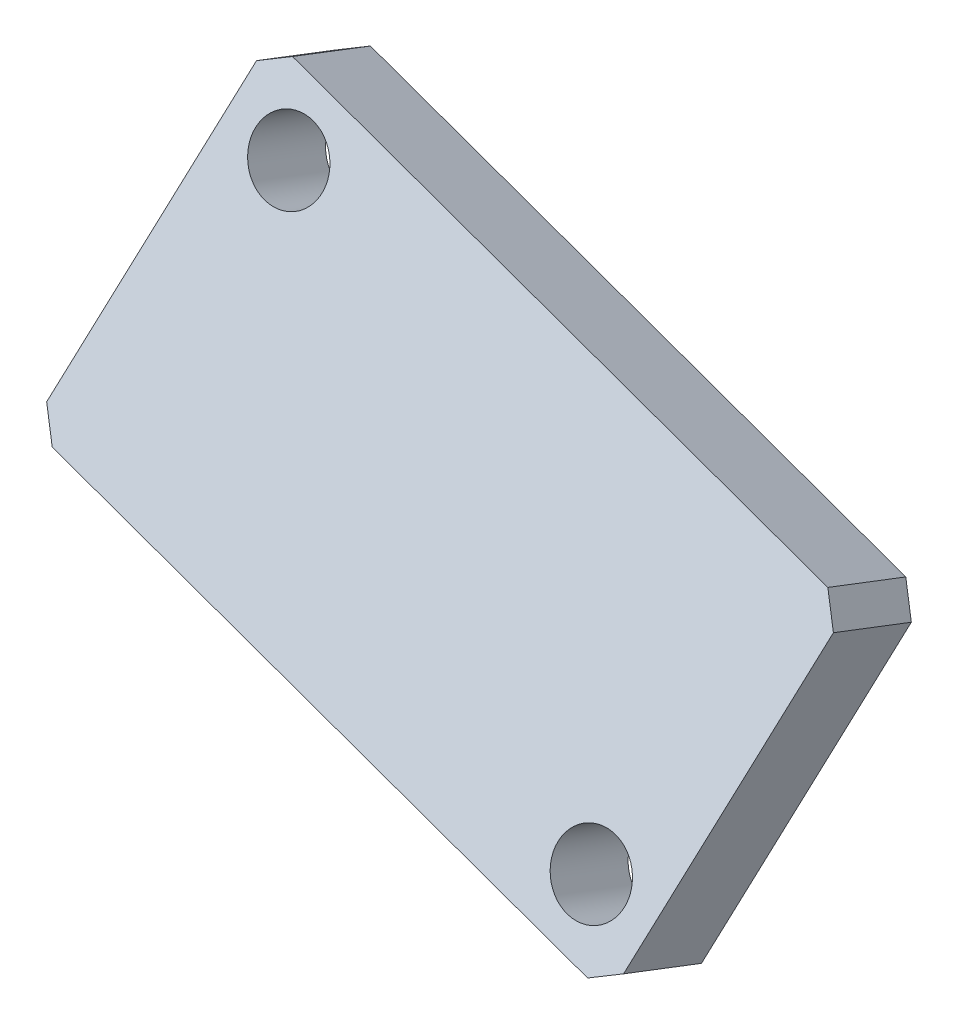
ISO-10303-21;
HEADER;
FILE_DESCRIPTION(('STEP AP214'),'2;1');
FILE_NAME('part.step','',(''),(''),'','','');
FILE_SCHEMA(('AUTOMOTIVE_DESIGN { 1 0 10303 214 1 1 1 1 }'));
ENDSEC;
DATA;
#1=APPLICATION_CONTEXT('core data for automotive mechanical design processes');
#2=APPLICATION_PROTOCOL_DEFINITION('international standard','automotive_design',2000,#1);
#3=PRODUCT_CONTEXT('',#1,'mechanical');
#4=PRODUCT('Part','Part','',(#3));
#5=PRODUCT_RELATED_PRODUCT_CATEGORY('part','',(#4));
#6=PRODUCT_DEFINITION_FORMATION('','',#4);
#7=PRODUCT_DEFINITION_CONTEXT('part definition',#1,'design');
#8=PRODUCT_DEFINITION('design','',#6,#7);
#9=PRODUCT_DEFINITION_SHAPE('','',#8);
#10=(LENGTH_UNIT() NAMED_UNIT(*) SI_UNIT(.MILLI.,.METRE.));
#11=(NAMED_UNIT(*) PLANE_ANGLE_UNIT() SI_UNIT($,.RADIAN.));
#12=(NAMED_UNIT(*) SI_UNIT($,.STERADIAN.) SOLID_ANGLE_UNIT());
#13=UNCERTAINTY_MEASURE_WITH_UNIT(LENGTH_MEASURE(1.E-05),#10,'distance_accuracy_value','');
#14=(GEOMETRIC_REPRESENTATION_CONTEXT(3) GLOBAL_UNCERTAINTY_ASSIGNED_CONTEXT((#13)) GLOBAL_UNIT_ASSIGNED_CONTEXT((#10,
#11,#12)) REPRESENTATION_CONTEXT('',''));
#15=CARTESIAN_POINT('',(0.,0.,0.));
#16=DIRECTION('',(0.,0.,1.));
#17=DIRECTION('',(1.,0.,0.));
#18=AXIS2_PLACEMENT_3D('',#15,#16,#17);
#19=CARTESIAN_POINT('',(54.9942323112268,-5.08060620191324,-242.139668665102));
#20=DIRECTION('',(-0.0641332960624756,-0.391467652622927,-0.917954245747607));
#21=DIRECTION('',(0.,0.919847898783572,-0.392275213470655));
#22=AXIS2_PLACEMENT_3D('',#19,#20,#21);
#23=PLANE('',#22);
#24=CARTESIAN_POINT('',(30.2599275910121,-0.556920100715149,-242.340750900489));
#25=DIRECTION('',(0.0641332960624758,0.391467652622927,0.917954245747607));
#26=DIRECTION('',(0.,-0.919847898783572,0.392275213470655));
#27=AXIS2_PLACEMENT_3D('',#24,#25,#26);
#28=CIRCLE('',#27,1.6);
#29=CARTESIAN_POINT('',(30.2599275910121,-2.02867673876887,-241.713110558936));
#30=VERTEX_POINT('',#29);
#31=EDGE_CURVE('E165',#30,#30,#28,.T.);
#32=ORIENTED_EDGE('',*,*,#31,.F.);
#33=EDGE_LOOP('',(#32));
#34=FACE_BOUND('',#33,.T.);
#35=DIRECTION('',(0.959896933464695,-0.275760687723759,0.0505363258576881));
#36=VECTOR('',#35,1.);
#37=CARTESIAN_POINT('',(50.6821116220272,-18.9514325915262,-235.923094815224));
#38=LINE('',#37,#36);
#39=CARTESIAN_POINT('',(24.9568738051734,-11.5610461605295,-237.27746834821));
#40=VERTEX_POINT('',#39);
#41=CARTESIAN_POINT('',(49.7222146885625,-18.6756719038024,-235.973631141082));
#42=VERTEX_POINT('',#41);
#43=EDGE_CURVE('E172',#40,#42,#38,.T.);
#44=ORIENTED_EDGE('',*,*,#43,.T.);
#45=DIRECTION('',(-0.871732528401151,-0.425777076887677,0.242479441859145));
#46=VECTOR('',#45,1.);
#47=CARTESIAN_POINT('',(50.9550306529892,-18.0735321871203,-236.316548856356));
#48=LINE('',#47,#46);
#49=CARTESIAN_POINT('',(50.9550306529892,-18.0735321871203,-236.316548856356));
#50=VERTEX_POINT('',#49);
#51=EDGE_CURVE('E149',#42,#50,#48,.F.);
#52=ORIENTED_EDGE('',*,*,#51,.T.);
#53=DIRECTION('',(0.272919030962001,0.877900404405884,-0.39345404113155));
#54=VECTOR('',#53,1.);
#55=CARTESIAN_POINT('',(54.9942323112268,-5.08060620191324,-242.139668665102));
#56=LINE('',#55,#54);
#57=CARTESIAN_POINT('',(54.7213132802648,-5.95850660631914,-241.746214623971));
#58=VERTEX_POINT('',#57);
#59=EDGE_CURVE('E120',#50,#58,#56,.T.);
#60=ORIENTED_EDGE('',*,*,#59,.T.);
#61=DIRECTION('',(0.485766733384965,-0.815761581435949,0.313948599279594));
#62=VECTOR('',#61,1.);
#63=CARTESIAN_POINT('',(54.0343353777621,-4.80484551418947,-242.19020499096));
#64=LINE('',#63,#62);
#65=CARTESIAN_POINT('',(54.0343353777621,-4.80484551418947,-242.19020499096));
#66=VERTEX_POINT('',#65);
#67=EDGE_CURVE('E147',#58,#66,#64,.F.);
#68=ORIENTED_EDGE('',*,*,#67,.T.);
#69=DIRECTION('',(-0.959896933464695,0.275760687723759,-0.0505363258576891));
#70=VECTOR('',#69,1.);
#71=CARTESIAN_POINT('',(28.3090975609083,2.58554091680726,-243.544578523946));
#72=LINE('',#71,#70);
#73=CARTESIAN_POINT('',(29.268994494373,2.3097802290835,-243.494042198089));
#74=VERTEX_POINT('',#73);
#75=EDGE_CURVE('E127',#66,#74,#72,.T.);
#76=ORIENTED_EDGE('',*,*,#75,.T.);
#77=DIRECTION('',(0.87173252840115,0.425777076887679,-0.242479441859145));
#78=VECTOR('',#77,1.);
#79=CARTESIAN_POINT('',(28.0361785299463,1.70764051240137,-243.151124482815));
#80=LINE('',#79,#78);
#81=CARTESIAN_POINT('',(28.0361785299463,1.70764051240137,-243.151124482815));
#82=VERTEX_POINT('',#81);
#83=EDGE_CURVE('E55',#74,#82,#80,.F.);
#84=ORIENTED_EDGE('',*,*,#83,.T.);
#85=DIRECTION('',(-0.272919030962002,-0.877900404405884,0.393454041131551));
#86=VECTOR('',#85,1.);
#87=CARTESIAN_POINT('',(23.9969768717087,-11.2852854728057,-237.328004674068));
#88=LINE('',#87,#86);
#89=CARTESIAN_POINT('',(24.2698959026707,-10.4073850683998,-237.721458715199));
#90=VERTEX_POINT('',#89);
#91=EDGE_CURVE('E130',#82,#90,#88,.T.);
#92=ORIENTED_EDGE('',*,*,#91,.T.);
#93=DIRECTION('',(-0.485766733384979,0.815761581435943,-0.313948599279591));
#94=VECTOR('',#93,1.);
#95=CARTESIAN_POINT('',(24.9568738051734,-11.5610461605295,-237.27746834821));
#96=LINE('',#95,#94);
#97=EDGE_CURVE('E144',#90,#40,#96,.F.);
#98=ORIENTED_EDGE('',*,*,#97,.T.);
#99=EDGE_LOOP('',(#44,#52,#60,#68,#76,#84,#92,#98));
#100=FACE_BOUND('',#99,.T.);
#101=CARTESIAN_POINT('',(48.7312815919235,-15.8089715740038,-237.126922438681));
#102=DIRECTION('',(0.0641332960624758,0.391467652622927,0.917954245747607));
#103=DIRECTION('',(0.,-0.919847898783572,0.392275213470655));
#104=AXIS2_PLACEMENT_3D('',#101,#102,#103);
#105=CIRCLE('',#104,1.59999999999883);
#106=CARTESIAN_POINT('',(48.7312815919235,-17.2807282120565,-236.499282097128));
#107=VERTEX_POINT('',#106);
#108=EDGE_CURVE('E177',#107,#107,#105,.T.);
#109=ORIENTED_EDGE('',*,*,#108,.F.);
#110=EDGE_LOOP('',(#109));
#111=FACE_BOUND('',#110,.T.);
#112=ADVANCED_FACE('F34',(#34,#100,#111),#23,.F.);
#113=CARTESIAN_POINT('',(54.7376991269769,-6.64647681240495,-245.811485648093));
#114=DIRECTION('',(-0.0641332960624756,-0.391467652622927,-0.917954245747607));
#115=DIRECTION('',(0.,0.919847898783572,-0.392275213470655));
#116=AXIS2_PLACEMENT_3D('',#113,#114,#115);
#117=PLANE('',#116);
#118=CARTESIAN_POINT('',(30.0033944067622,-2.12279071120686,-246.01256788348));
#119=DIRECTION('',(0.0641332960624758,0.391467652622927,0.917954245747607));
#120=DIRECTION('',(0.,-0.919847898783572,0.392275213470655));
#121=AXIS2_PLACEMENT_3D('',#118,#119,#120);
#122=CIRCLE('',#121,1.6);
#123=CARTESIAN_POINT('',(30.0033944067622,-3.59454734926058,-245.384927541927));
#124=VERTEX_POINT('',#123);
#125=EDGE_CURVE('E168',#124,#124,#122,.T.);
#126=ORIENTED_EDGE('',*,*,#125,.T.);
#127=EDGE_LOOP('',(#126));
#128=FACE_BOUND('',#127,.T.);
#129=DIRECTION('',(0.272919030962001,0.877900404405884,-0.39345404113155));
#130=VECTOR('',#129,1.);
#131=CARTESIAN_POINT('',(54.7376991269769,-6.64647681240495,-245.811485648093));
#132=LINE('',#131,#130);
#133=CARTESIAN_POINT('',(50.6984974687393,-19.639402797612,-239.988365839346));
#134=VERTEX_POINT('',#133);
#135=CARTESIAN_POINT('',(54.4647800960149,-7.52437721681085,-245.418031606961));
#136=VERTEX_POINT('',#135);
#137=EDGE_CURVE('E117',#134,#136,#132,.T.);
#138=ORIENTED_EDGE('',*,*,#137,.F.);
#139=DIRECTION('',(0.871732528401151,0.425777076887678,-0.242479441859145));
#140=VECTOR('',#139,1.);
#141=CARTESIAN_POINT('',(59.8213356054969,-15.1835688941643,-242.525956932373));
#142=LINE('',#141,#140);
#143=CARTESIAN_POINT('',(49.4656815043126,-20.2415425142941,-239.645448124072));
#144=VERTEX_POINT('',#143);
#145=EDGE_CURVE('E100',#134,#144,#142,.F.);
#146=ORIENTED_EDGE('',*,*,#145,.T.);
#147=DIRECTION('',(0.959896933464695,-0.275760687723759,0.0505363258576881));
#148=VECTOR('',#147,1.);
#149=CARTESIAN_POINT('',(50.4255784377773,-20.5173032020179,-239.594911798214));
#150=LINE('',#149,#148);
#151=CARTESIAN_POINT('',(24.7003406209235,-13.1269167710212,-240.9492853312));
#152=VERTEX_POINT('',#151);
#153=EDGE_CURVE('E128',#152,#144,#150,.T.);
#154=ORIENTED_EDGE('',*,*,#153,.F.);
#155=DIRECTION('',(0.485766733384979,-0.815761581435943,0.313948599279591));
#156=VECTOR('',#155,1.);
#157=CARTESIAN_POINT('',(28.4787190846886,-19.4720527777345,-238.50733831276));
#158=LINE('',#157,#156);
#159=CARTESIAN_POINT('',(24.0133627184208,-11.9732556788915,-241.39327569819));
#160=VERTEX_POINT('',#159);
#161=EDGE_CURVE('E121',#152,#160,#158,.F.);
#162=ORIENTED_EDGE('',*,*,#161,.T.);
#163=DIRECTION('',(-0.272919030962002,-0.877900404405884,0.393454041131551));
#164=VECTOR('',#163,1.);
#165=CARTESIAN_POINT('',(23.7404436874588,-12.8511560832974,-240.999821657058));
#166=LINE('',#165,#164);
#167=CARTESIAN_POINT('',(27.7796453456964,0.14176990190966,-246.822941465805));
#168=VERTEX_POINT('',#167);
#169=EDGE_CURVE('E132',#168,#160,#166,.T.);
#170=ORIENTED_EDGE('',*,*,#169,.F.);
#171=DIRECTION('',(-0.87173252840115,-0.425777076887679,0.242479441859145));
#172=VECTOR('',#171,1.);
#173=CARTESIAN_POINT('',(45.5321952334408,8.81258182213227,-251.760956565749));
#174=LINE('',#173,#172);
#175=CARTESIAN_POINT('',(29.0124613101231,0.743909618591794,-247.165859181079));
#176=VERTEX_POINT('',#175);
#177=EDGE_CURVE('E138',#168,#176,#174,.F.);
#178=ORIENTED_EDGE('',*,*,#177,.T.);
#179=DIRECTION('',(-0.959896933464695,0.275760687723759,-0.0505363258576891));
#180=VECTOR('',#179,1.);
#181=CARTESIAN_POINT('',(28.0525643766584,1.01967030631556,-247.216395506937));
#182=LINE('',#181,#180);
#183=CARTESIAN_POINT('',(53.7778021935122,-6.37071612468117,-245.862021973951));
#184=VERTEX_POINT('',#183);
#185=EDGE_CURVE('E160',#184,#176,#182,.T.);
#186=ORIENTED_EDGE('',*,*,#185,.F.);
#187=DIRECTION('',(-0.485766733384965,0.815761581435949,-0.313948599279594));
#188=VECTOR('',#187,1.);
#189=CARTESIAN_POINT('',(54.1212911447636,-6.94754667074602,-245.640026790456));
#190=LINE('',#189,#188);
#191=EDGE_CURVE('E111',#184,#136,#190,.F.);
#192=ORIENTED_EDGE('',*,*,#191,.T.);
#193=EDGE_LOOP('',(#138,#146,#154,#162,#170,#178,#186,#192));
#194=FACE_BOUND('',#193,.T.);
#195=CARTESIAN_POINT('',(48.4747484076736,-17.3748421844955,-240.798739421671));
#196=DIRECTION('',(0.0641332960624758,0.391467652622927,0.917954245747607));
#197=DIRECTION('',(0.,-0.919847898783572,0.392275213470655));
#198=AXIS2_PLACEMENT_3D('',#195,#196,#197);
#199=CIRCLE('',#198,1.59999999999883);
#200=CARTESIAN_POINT('',(48.4747484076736,-18.8465988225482,-240.171099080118));
#201=VERTEX_POINT('',#200);
#202=EDGE_CURVE('E179',#201,#201,#199,.T.);
#203=ORIENTED_EDGE('',*,*,#202,.T.);
#204=EDGE_LOOP('',(#203));
#205=FACE_BOUND('',#204,.T.);
#206=ADVANCED_FACE('F124',(#128,#194,#205),#117,.T.);
#207=CARTESIAN_POINT('',(28.3090975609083,2.58554091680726,-243.544578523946));
#208=DIRECTION('',(-0.272919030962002,-0.877900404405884,0.39345404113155));
#209=DIRECTION('',(0.,-0.408980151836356,-0.912543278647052));
#210=AXIS2_PLACEMENT_3D('',#207,#208,#209);
#211=PLANE('',#210);
#212=ORIENTED_EDGE('',*,*,#75,.F.);
#213=DIRECTION('',(-0.0641332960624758,-0.391467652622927,-0.917954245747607));
#214=VECTOR('',#213,1.);
#215=CARTESIAN_POINT('',(54.0343353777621,-4.80484551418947,-242.19020499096));
#216=LINE('',#215,#214);
#217=EDGE_CURVE('E153',#66,#184,#216,.T.);
#218=ORIENTED_EDGE('',*,*,#217,.T.);
#219=ORIENTED_EDGE('',*,*,#185,.T.);
#220=DIRECTION('',(0.0641332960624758,0.391467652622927,0.917954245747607));
#221=VECTOR('',#220,1.);
#222=CARTESIAN_POINT('',(29.268994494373,2.3097802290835,-243.494042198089));
#223=LINE('',#222,#221);
#224=EDGE_CURVE('E151',#176,#74,#223,.T.);
#225=ORIENTED_EDGE('',*,*,#224,.T.);
#226=EDGE_LOOP('',(#212,#218,#219,#225));
#227=FACE_BOUND('',#226,.T.);
#228=ADVANCED_FACE('F159',(#227),#211,.F.);
#229=CARTESIAN_POINT('',(23.9969768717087,-11.2852854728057,-237.328004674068));
#230=DIRECTION('',(0.959896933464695,-0.275760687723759,0.0505363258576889));
#231=DIRECTION('',(0.276113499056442,0.961125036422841,0.));
#232=AXIS2_PLACEMENT_3D('',#229,#230,#231);
#233=PLANE('',#232);
#234=ORIENTED_EDGE('',*,*,#91,.F.);
#235=DIRECTION('',(-0.0641332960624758,-0.391467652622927,-0.917954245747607));
#236=VECTOR('',#235,1.);
#237=CARTESIAN_POINT('',(28.0361785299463,1.70764051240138,-243.151124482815));
#238=LINE('',#237,#236);
#239=EDGE_CURVE('E11',#82,#168,#238,.T.);
#240=ORIENTED_EDGE('',*,*,#239,.T.);
#241=ORIENTED_EDGE('',*,*,#169,.T.);
#242=DIRECTION('',(0.0641332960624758,0.391467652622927,0.917954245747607));
#243=VECTOR('',#242,1.);
#244=CARTESIAN_POINT('',(24.2698959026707,-10.4073850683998,-237.721458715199));
#245=LINE('',#244,#243);
#246=EDGE_CURVE('E42',#160,#90,#245,.T.);
#247=ORIENTED_EDGE('',*,*,#246,.T.);
#248=EDGE_LOOP('',(#234,#240,#241,#247));
#249=FACE_BOUND('',#248,.T.);
#250=ADVANCED_FACE('F206',(#249),#233,.F.);
#251=CARTESIAN_POINT('',(50.6821116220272,-18.9514325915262,-235.923094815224));
#252=DIRECTION('',(0.272919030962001,0.877900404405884,-0.39345404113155));
#253=DIRECTION('',(0.,0.408980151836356,0.912543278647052));
#254=AXIS2_PLACEMENT_3D('',#251,#252,#253);
#255=PLANE('',#254);
#256=ORIENTED_EDGE('',*,*,#153,.T.);
#257=DIRECTION('',(0.0641332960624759,0.391467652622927,0.917954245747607));
#258=VECTOR('',#257,1.);
#259=CARTESIAN_POINT('',(49.7222146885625,-18.6756719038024,-235.973631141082));
#260=LINE('',#259,#258);
#261=EDGE_CURVE('E105',#144,#42,#260,.T.);
#262=ORIENTED_EDGE('',*,*,#261,.T.);
#263=ORIENTED_EDGE('',*,*,#43,.F.);
#264=DIRECTION('',(-0.0641332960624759,-0.391467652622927,-0.917954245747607));
#265=VECTOR('',#264,1.);
#266=CARTESIAN_POINT('',(24.9568738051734,-11.5610461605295,-237.27746834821));
#267=LINE('',#266,#265);
#268=EDGE_CURVE('E110',#40,#152,#267,.T.);
#269=ORIENTED_EDGE('',*,*,#268,.T.);
#270=EDGE_LOOP('',(#256,#262,#263,#269));
#271=FACE_BOUND('',#270,.T.);
#272=ADVANCED_FACE('F203',(#271),#255,.F.);
#273=CARTESIAN_POINT('',(54.9942323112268,-5.08060620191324,-242.139668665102));
#274=DIRECTION('',(-0.959896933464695,0.275760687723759,-0.0505363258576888));
#275=DIRECTION('',(-0.276113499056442,-0.961125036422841,0.));
#276=AXIS2_PLACEMENT_3D('',#273,#274,#275);
#277=PLANE('',#276);
#278=ORIENTED_EDGE('',*,*,#59,.F.);
#279=DIRECTION('',(-0.0641332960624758,-0.391467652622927,-0.917954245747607));
#280=VECTOR('',#279,1.);
#281=CARTESIAN_POINT('',(50.9550306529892,-18.0735321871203,-236.316548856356));
#282=LINE('',#281,#280);
#283=EDGE_CURVE('E104',#50,#134,#282,.T.);
#284=ORIENTED_EDGE('',*,*,#283,.T.);
#285=ORIENTED_EDGE('',*,*,#137,.T.);
#286=DIRECTION('',(0.0641332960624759,0.391467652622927,0.917954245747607));
#287=VECTOR('',#286,1.);
#288=CARTESIAN_POINT('',(54.7213132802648,-5.95850660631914,-241.746214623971));
#289=LINE('',#288,#287);
#290=EDGE_CURVE('E122',#136,#58,#289,.T.);
#291=ORIENTED_EDGE('',*,*,#290,.T.);
#292=EDGE_LOOP('',(#278,#284,#285,#291));
#293=FACE_BOUND('',#292,.T.);
#294=ADVANCED_FACE('F116',(#293),#277,.F.);
#295=CARTESIAN_POINT('',(30.2599275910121,-0.556920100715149,-242.340750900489));
#296=DIRECTION('',(-0.0641332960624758,-0.391467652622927,-0.917954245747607));
#297=DIRECTION('',(0.,0.919847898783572,-0.392275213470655));
#298=AXIS2_PLACEMENT_3D('',#295,#296,#297);
#299=CYLINDRICAL_SURFACE('',#298,1.6);
#300=ORIENTED_EDGE('',*,*,#31,.T.);
#301=EDGE_LOOP('',(#300));
#302=FACE_BOUND('',#301,.T.);
#303=ORIENTED_EDGE('',*,*,#125,.F.);
#304=EDGE_LOOP('',(#303));
#305=FACE_BOUND('',#304,.T.);
#306=ADVANCED_FACE('F198',(#302,#305),#299,.F.);
#307=CARTESIAN_POINT('',(48.7312815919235,-15.8089715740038,-237.126922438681));
#308=DIRECTION('',(-0.0641332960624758,-0.391467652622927,-0.917954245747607));
#309=DIRECTION('',(0.,0.919847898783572,-0.392275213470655));
#310=AXIS2_PLACEMENT_3D('',#307,#308,#309);
#311=CYLINDRICAL_SURFACE('',#310,1.59999999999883);
#312=ORIENTED_EDGE('',*,*,#108,.T.);
#313=EDGE_LOOP('',(#312));
#314=FACE_BOUND('',#313,.T.);
#315=ORIENTED_EDGE('',*,*,#202,.F.);
#316=EDGE_LOOP('',(#315));
#317=FACE_BOUND('',#316,.T.);
#318=ADVANCED_FACE('F185',(#314,#317),#311,.F.);
#319=CARTESIAN_POINT('',(50.9550306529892,-18.0735321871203,-236.316548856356));
#320=DIRECTION('',(-0.485766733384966,0.815761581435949,-0.313948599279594));
#321=DIRECTION('',(-0.859202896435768,-0.511635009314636,0.));
#322=AXIS2_PLACEMENT_3D('',#319,#320,#321);
#323=PLANE('',#322);
#324=ORIENTED_EDGE('',*,*,#51,.F.);
#325=ORIENTED_EDGE('',*,*,#261,.F.);
#326=ORIENTED_EDGE('',*,*,#145,.F.);
#327=ORIENTED_EDGE('',*,*,#283,.F.);
#328=EDGE_LOOP('',(#324,#325,#326,#327));
#329=FACE_BOUND('',#328,.T.);
#330=ADVANCED_FACE('F103',(#329),#323,.F.);
#331=CARTESIAN_POINT('',(54.0343353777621,-4.80484551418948,-242.19020499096));
#332=DIRECTION('',(-0.871732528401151,-0.425777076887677,0.242479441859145));
#333=DIRECTION('',(0.438874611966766,-0.898548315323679,0.));
#334=AXIS2_PLACEMENT_3D('',#331,#332,#333);
#335=PLANE('',#334);
#336=ORIENTED_EDGE('',*,*,#67,.F.);
#337=ORIENTED_EDGE('',*,*,#290,.F.);
#338=ORIENTED_EDGE('',*,*,#191,.F.);
#339=ORIENTED_EDGE('',*,*,#217,.F.);
#340=EDGE_LOOP('',(#336,#337,#338,#339));
#341=FACE_BOUND('',#340,.T.);
#342=ADVANCED_FACE('F214',(#341),#335,.F.);
#343=CARTESIAN_POINT('',(28.0361785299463,1.70764051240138,-243.151124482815));
#344=DIRECTION('',(0.485766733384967,-0.815761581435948,0.313948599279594));
#345=DIRECTION('',(0.859202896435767,0.511635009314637,0.));
#346=AXIS2_PLACEMENT_3D('',#343,#344,#345);
#347=PLANE('',#346);
#348=ORIENTED_EDGE('',*,*,#83,.F.);
#349=ORIENTED_EDGE('',*,*,#224,.F.);
#350=ORIENTED_EDGE('',*,*,#177,.F.);
#351=ORIENTED_EDGE('',*,*,#239,.F.);
#352=EDGE_LOOP('',(#348,#349,#350,#351));
#353=FACE_BOUND('',#352,.T.);
#354=ADVANCED_FACE('F216',(#353),#347,.F.);
#355=CARTESIAN_POINT('',(24.9568738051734,-11.5610461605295,-237.27746834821));
#356=DIRECTION('',(0.871732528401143,0.425777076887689,-0.24247944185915));
#357=DIRECTION('',(-0.438874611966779,0.898548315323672,0.));
#358=AXIS2_PLACEMENT_3D('',#355,#356,#357);
#359=PLANE('',#358);
#360=ORIENTED_EDGE('',*,*,#97,.F.);
#361=ORIENTED_EDGE('',*,*,#246,.F.);
#362=ORIENTED_EDGE('',*,*,#161,.F.);
#363=ORIENTED_EDGE('',*,*,#268,.F.);
#364=EDGE_LOOP('',(#360,#361,#362,#363));
#365=FACE_BOUND('',#364,.T.);
#366=ADVANCED_FACE('F36',(#365),#359,.F.);
#367=CLOSED_SHELL('',(#112,#206,#228,#250,#272,#294,#306,#318,#330,#342,#354,#366));
#368=MANIFOLD_SOLID_BREP('B2',#367);
#369=ADVANCED_BREP_SHAPE_REPRESENTATION('',(#18,#368),#14);
#370=SHAPE_DEFINITION_REPRESENTATION(#9,#369);
ENDSEC;
END-ISO-10303-21;
